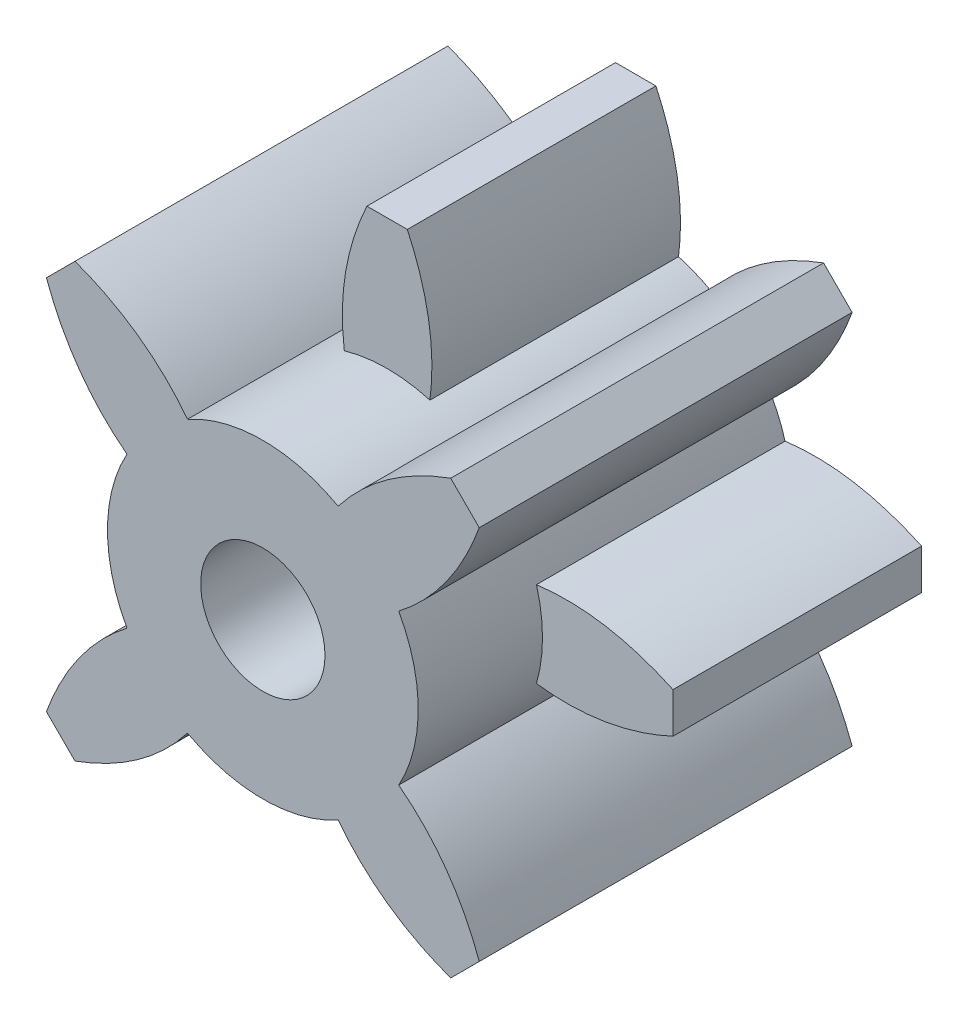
from build123d import *

# Parameters (mm, degrees)
EXTRUDE_1_DEPTH     = 30
EXTRUDE_1_2_DEPTH   = 30
EXTRUDE_1_3_DEPTH   = 30
EXTRUDE_1_4_DEPTH   = 30
EXTRUDE_1_5_DEPTH   = 30
EXTRUDE_1_6_DEPTH   = 30
EXTRUDE_1_7_DEPTH   = 30
EXTRUDE_1_8_DEPTH   = 30
SKETCH_4_R          = 12.5
SKETCH_4_R_2        = 5
EXTRUDE_2_DEPTH     = 30
CUT_EXTRUDE_1_DEPTH = 10


with BuildPart() as part:
    # Sketch 3 → Extrude 1 (new body)
    with BuildSketch(Plane.XY):
        with BuildLine():
            Line((-1.625, 40), (1.625, 40))
            add(Edge.make_bspline(
                [(1.625, 40), (4.161640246, 45.46345518), (3.445466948, 50.984228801)],
                knots=[0, 0, 0, 1, 1, 1], degree=2))
            ThreePointArc((3.445466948, 50.984228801), (0, 50.5), (-3.445466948, 50.984228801))
            add(Edge.make_bspline(
                [(-1.625, 40), (-4.161640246, 45.46345518), (-3.445466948, 50.984228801)],
                knots=[0, 0, 0, 1, 1, 1], degree=2))
        make_face()
    extrude(amount=-EXTRUDE_1_DEPTH)



with BuildPart() as body_2:
    # Sketch 3 → Extrude 1 2 (new body)
    with BuildSketch(Plane.XY):
        with BuildLine():
            Line((15.114407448, 45.587495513), (17.412504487, 47.885592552))
            add(Edge.make_bspline(
                [(17.412504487, 47.885592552), (15.342933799, 53.542514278), (10.932746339, 56.939879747)],
                knots=[0, 0, 0, 1, 1, 1], degree=2))
            ThreePointArc((10.932746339, 56.939879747), (8.838834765, 54.161165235), (6.060120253, 52.067253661))
            add(Edge.make_bspline(
                [(15.114407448, 45.587495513), (9.457485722, 47.657066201), (6.060120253, 52.067253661)],
                knots=[0, 0, 0, 1, 1, 1], degree=2))
        make_face()
    extrude(amount=-EXTRUDE_1_2_DEPTH)


with BuildPart() as body_3:
    # Sketch 3 → Extrude 1 3 (new body)
    with BuildSketch(Plane.XY):
        with BuildLine():
            Line((23, 61.375), (23, 64.625))
            add(Edge.make_bspline(
                [(23, 64.625), (17.53654482, 67.161640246), (12.015771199, 66.445466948)],
                knots=[0, 0, 0, 1, 1, 1], degree=2))
            ThreePointArc((12.015771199, 66.445466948), (12.5, 63), (12.015771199, 59.554533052))
            add(Edge.make_bspline(
                [(23, 61.375), (17.53654482, 58.838359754), (12.015771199, 59.554533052)],
                knots=[0, 0, 0, 1, 1, 1], degree=2))
        make_face()
    extrude(amount=-EXTRUDE_1_3_DEPTH)


with BuildPart() as body_4:
    # Sketch 3 → Extrude 1 4 (new body)
    with BuildSketch(Plane.XY):
        with BuildLine():
            Line((17.412504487, 78.114407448), (15.114407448, 80.412504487))
            add(Edge.make_bspline(
                [(15.114407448, 80.412504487), (9.457485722, 78.342933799), (6.060120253, 73.932746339)],
                knots=[0, 0, 0, 1, 1, 1], degree=2))
            ThreePointArc((6.060120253, 73.932746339), (8.838834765, 71.838834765), (10.932746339, 69.060120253))
            add(Edge.make_bspline(
                [(17.412504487, 78.114407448), (15.342933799, 72.457485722), (10.932746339, 69.060120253)],
                knots=[0, 0, 0, 1, 1, 1], degree=2))
        make_face()
    extrude(amount=-EXTRUDE_1_4_DEPTH)


with BuildPart() as body_5:
    # Sketch 3 → Extrude 1 5 (new body)
    with BuildSketch(Plane.XY):
        with BuildLine():
            Line((1.625, 86), (-1.625, 86))
            add(Edge.make_bspline(
                [(-1.625, 86), (-4.161640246, 80.53654482), (-3.445466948, 75.015771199)],
                knots=[0, 0, 0, 1, 1, 1], degree=2))
            ThreePointArc((-3.445466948, 75.015771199), (0, 75.5), (3.445466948, 75.015771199))
            add(Edge.make_bspline(
                [(1.625, 86), (4.161640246, 80.53654482), (3.445466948, 75.015771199)],
                knots=[0, 0, 0, 1, 1, 1], degree=2))
        make_face()
    extrude(amount=-EXTRUDE_1_5_DEPTH)


with BuildPart() as body_6:
    # Sketch 3 → Extrude 1 6 (new body)
    with BuildSketch(Plane.XY):
        with BuildLine():
            Line((-15.114407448, 80.412504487), (-17.412504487, 78.114407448))
            add(Edge.make_bspline(
                [(-17.412504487, 78.114407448), (-15.342933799, 72.457485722), (-10.932746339, 69.060120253)],
                knots=[0, 0, 0, 1, 1, 1], degree=2))
            ThreePointArc((-10.932746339, 69.060120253), (-8.838834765, 71.838834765), (-6.060120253, 73.932746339))
            add(Edge.make_bspline(
                [(-15.114407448, 80.412504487), (-9.457485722, 78.342933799), (-6.060120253, 73.932746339)],
                knots=[0, 0, 0, 1, 1, 1], degree=2))
        make_face()
    extrude(amount=-EXTRUDE_1_6_DEPTH)


with BuildPart() as body_7:
    # Sketch 3 → Extrude 1 7 (new body)
    with BuildSketch(Plane.XY):
        with BuildLine():
            Line((-23, 64.625), (-23, 61.375))
            add(Edge.make_bspline(
                [(-23, 61.375), (-17.53654482, 58.838359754), (-12.015771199, 59.554533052)],
                knots=[0, 0, 0, 1, 1, 1], degree=2))
            ThreePointArc((-12.015771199, 59.554533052), (-12.5, 63), (-12.015771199, 66.445466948))
            add(Edge.make_bspline(
                [(-23, 64.625), (-17.53654482, 67.161640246), (-12.015771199, 66.445466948)],
                knots=[0, 0, 0, 1, 1, 1], degree=2))
        make_face()
    extrude(amount=-EXTRUDE_1_7_DEPTH)


with BuildPart() as body_8:
    # Sketch 3 → Extrude 1 8 (new body)
    with BuildSketch(Plane.XY):
        with BuildLine():
            Line((-17.412504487, 47.885592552), (-15.114407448, 45.587495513))
            add(Edge.make_bspline(
                [(-15.114407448, 45.587495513), (-9.457485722, 47.657066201), (-6.060120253, 52.067253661)],
                knots=[0, 0, 0, 1, 1, 1], degree=2))
            ThreePointArc((-6.060120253, 52.067253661), (-8.838834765, 54.161165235), (-10.932746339, 56.939879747))
            add(Edge.make_bspline(
                [(-17.412504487, 47.885592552), (-15.342933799, 53.542514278), (-10.932746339, 56.939879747)],
                knots=[0, 0, 0, 1, 1, 1], degree=2))
        make_face()
    extrude(amount=-EXTRUDE_1_8_DEPTH)


with BuildPart() as part_1:
    add(part.part)

    add(body_2.part)  # Extrude 2 merges body 2

    add(body_3.part)  # Extrude 2 merges body 3

    add(body_4.part)  # Extrude 2 merges body 4

    add(body_5.part)  # Extrude 2 merges body 5

    add(body_6.part)  # Extrude 2 merges body 6

    add(body_7.part)  # Extrude 2 merges body 7

    add(body_8.part)  # Extrude 2 merges body 8
    # Sketch 4 → Extrude 2 (add)
    with BuildSketch(Plane.XY):
        with Locations((0, 63)):
            Circle(SKETCH_4_R)
        with Locations((0, 63)):
            Circle(SKETCH_4_R_2, mode=Mode.SUBTRACT)
    extrude(amount=-EXTRUDE_2_DEPTH)

    # Sketch 5 → Cut-Extrude 1 (cut)
    with BuildSketch(Plane.XY):
        with BuildLine():
            Line((-1.624999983, 39.999999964), (1.625, 40))
            add(Edge.make_bspline(
                [(1.625, 40), (4.161640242, 45.463455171), (3.44546695, 50.984228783)],
                knots=[0, 0, 0, 1, 1, 1], degree=2))
            ThreePointArc((3.44546695, 50.984228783), (-1e-09, 50.5), (-3.445466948, 50.984228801))
            add(Edge.make_bspline(
                [(-3.445466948, 50.984228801), (-4.161640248, 45.463455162), (-1.624999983, 39.999999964)],
                knots=[0, 0, 0, 1, 1, 1], degree=2))
        make_face()
        with BuildLine():
            Line((23.000000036, 61.375000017), (23, 64.625))
            add(Edge.make_bspline(
                [(23, 64.625), (17.536544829, 67.161640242), (12.015771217, 66.44546695)],
                knots=[0, 0, 0, 1, 1, 1], degree=2))
            ThreePointArc((12.015771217, 66.44546695), (12.5, 62.999999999), (12.015771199, 59.554533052))
            add(Edge.make_bspline(
                [(12.015771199, 59.554533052), (17.536544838, 58.838359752), (23.000000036, 61.375000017)],
                knots=[0, 0, 0, 1, 1, 1], degree=2))
        make_face()
        with BuildLine():
            Line((1.624999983, 86.000000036), (-1.625, 86))
            add(Edge.make_bspline(
                [(-1.625, 86), (-4.161640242, 80.536544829), (-3.44546695, 75.015771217)],
                knots=[0, 0, 0, 1, 1, 1], degree=2))
            ThreePointArc((-3.44546695, 75.015771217), (1e-09, 75.5), (3.445466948, 75.015771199))
            add(Edge.make_bspline(
                [(3.445466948, 75.015771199), (4.161640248, 80.536544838), (1.624999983, 86.000000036)],
                knots=[0, 0, 0, 1, 1, 1], degree=2))
        make_face()
        with BuildLine():
            Line((-23.000000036, 64.624999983), (-23, 61.375))
            add(Edge.make_bspline(
                [(-23, 61.375), (-17.536544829, 58.838359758), (-12.015771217, 59.55453305)],
                knots=[0, 0, 0, 1, 1, 1], degree=2))
            ThreePointArc((-12.015771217, 59.55453305), (-12.5, 63.000000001), (-12.015771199, 66.445466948))
            add(Edge.make_bspline(
                [(-12.015771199, 66.445466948), (-17.536544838, 67.161640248), (-23.000000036, 64.624999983)],
                knots=[0, 0, 0, 1, 1, 1], degree=2))
        make_face()
    extrude(amount=-CUT_EXTRUDE_1_DEPTH, mode=Mode.SUBTRACT)


solid = part_1.part
